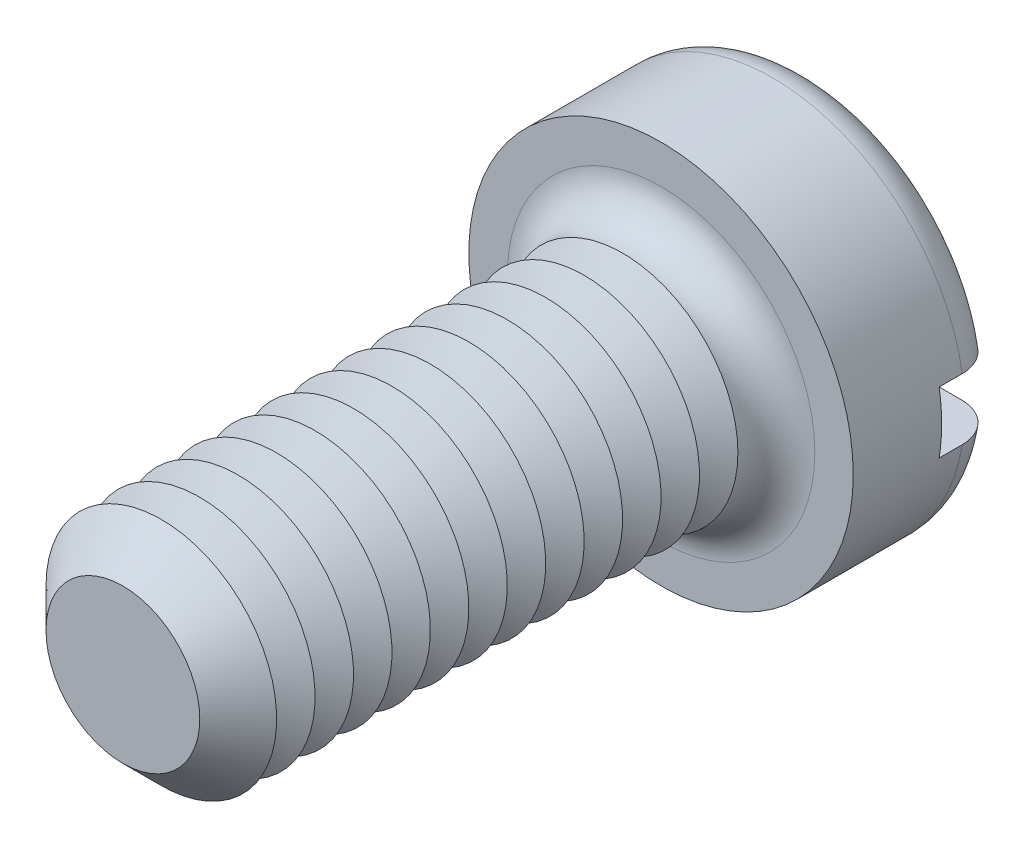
ISO-10303-21;
HEADER;
FILE_DESCRIPTION(('STEP AP214'),'2;1');
FILE_NAME('part.step','',(''),(''),'','','');
FILE_SCHEMA(('AUTOMOTIVE_DESIGN { 1 0 10303 214 1 1 1 1 }'));
ENDSEC;
DATA;
#1=APPLICATION_CONTEXT('core data for automotive mechanical design processes');
#2=APPLICATION_PROTOCOL_DEFINITION('international standard','automotive_design',2000,#1);
#3=PRODUCT_CONTEXT('',#1,'mechanical');
#4=PRODUCT('Part','Part','',(#3));
#5=PRODUCT_RELATED_PRODUCT_CATEGORY('part','',(#4));
#6=PRODUCT_DEFINITION_FORMATION('','',#4);
#7=PRODUCT_DEFINITION_CONTEXT('part definition',#1,'design');
#8=PRODUCT_DEFINITION('design','',#6,#7);
#9=PRODUCT_DEFINITION_SHAPE('','',#8);
#10=(LENGTH_UNIT() NAMED_UNIT(*) SI_UNIT(.MILLI.,.METRE.));
#11=(NAMED_UNIT(*) PLANE_ANGLE_UNIT() SI_UNIT($,.RADIAN.));
#12=(NAMED_UNIT(*) SI_UNIT($,.STERADIAN.) SOLID_ANGLE_UNIT());
#13=UNCERTAINTY_MEASURE_WITH_UNIT(LENGTH_MEASURE(1.E-05),#10,'distance_accuracy_value','');
#14=(GEOMETRIC_REPRESENTATION_CONTEXT(3) GLOBAL_UNCERTAINTY_ASSIGNED_CONTEXT((#13)) GLOBAL_UNIT_ASSIGNED_CONTEXT((#10,
#11,#12)) REPRESENTATION_CONTEXT('',''));
#15=CARTESIAN_POINT('',(0.,0.,0.));
#16=DIRECTION('',(0.,0.,1.));
#17=DIRECTION('',(1.,0.,0.));
#18=AXIS2_PLACEMENT_3D('',#15,#16,#17);
#19=CARTESIAN_POINT('',(0.,0.,-3.9));
#20=DIRECTION('',(0.,0.,1.));
#21=DIRECTION('',(1.,0.,0.));
#22=AXIS2_PLACEMENT_3D('',#19,#20,#21);
#23=PLANE('',#22);
#24=CARTESIAN_POINT('',(0.,0.,-3.9));
#25=DIRECTION('',(0.,0.,1.));
#26=DIRECTION('',(1.,0.,0.));
#27=AXIS2_PLACEMENT_3D('',#24,#25,#26);
#28=CIRCLE('',#27,4.);
#29=CARTESIAN_POINT('',(-3.91918358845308,0.800000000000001,-3.9));
#30=VERTEX_POINT('',#29);
#31=CARTESIAN_POINT('',(3.91918358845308,0.8,-3.9));
#32=VERTEX_POINT('',#31);
#33=EDGE_CURVE('E116',#30,#32,#28,.F.);
#34=ORIENTED_EDGE('',*,*,#33,.T.);
#35=DIRECTION('',(1.,0.,0.));
#36=VECTOR('',#35,1.);
#37=CARTESIAN_POINT('',(-5.,0.800000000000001,-3.9));
#38=LINE('',#37,#36);
#39=EDGE_CURVE('E111',#30,#32,#38,.T.);
#40=ORIENTED_EDGE('',*,*,#39,.F.);
#41=EDGE_LOOP('',(#34,#40));
#42=FACE_BOUND('',#41,.T.);
#43=ADVANCED_FACE('F39',(#42),#23,.F.);
#44=CARTESIAN_POINT('',(0.,0.,-2.9));
#45=DIRECTION('',(0.,0.,1.));
#46=DIRECTION('',(1.,0.,0.));
#47=AXIS2_PLACEMENT_3D('',#44,#45,#46);
#48=TOROIDAL_SURFACE('',#47,4.,1.);
#49=CARTESIAN_POINT('',(-4.76648512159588,0.800000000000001,-3.45304061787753));
#50=CARTESIAN_POINT('',(-4.73486405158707,0.800000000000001,-3.50001565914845));
#51=CARTESIAN_POINT('',(-4.69920787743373,0.800000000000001,-3.54432871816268));
#52=CARTESIAN_POINT('',(-4.62090302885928,0.800000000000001,-3.62634638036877));
#53=CARTESIAN_POINT('',(-4.57824494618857,0.800000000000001,-3.66404194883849));
#54=CARTESIAN_POINT('',(-4.48726975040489,0.800000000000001,-3.73172278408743));
#55=CARTESIAN_POINT('',(-4.43895902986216,0.800000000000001,-3.76171664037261));
#56=CARTESIAN_POINT('',(-4.33804923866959,0.800000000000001,-3.81326437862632));
#57=CARTESIAN_POINT('',(-4.2854512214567,0.800000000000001,-3.8348203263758));
#58=CARTESIAN_POINT('',(-4.17679895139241,0.800000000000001,-3.86918431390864));
#59=CARTESIAN_POINT('',(-4.12071163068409,0.800000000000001,-3.88188775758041));
#60=CARTESIAN_POINT('',(-4.00720729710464,0.800000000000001,-3.89785932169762));
#61=CARTESIAN_POINT('',(-3.94979011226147,0.800000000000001,-3.9011262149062));
#62=CARTESIAN_POINT('',(-3.83429042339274,0.800000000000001,-3.89816676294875));
#63=CARTESIAN_POINT('',(-3.77621176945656,0.800000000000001,-3.89178937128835));
#64=CARTESIAN_POINT('',(-3.66191938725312,0.800000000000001,-3.8694726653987));
#65=CARTESIAN_POINT('',(-3.60570580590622,0.800000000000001,-3.85353259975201));
#66=CARTESIAN_POINT('',(-3.49618749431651,0.800000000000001,-3.81233202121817));
#67=CARTESIAN_POINT('',(-3.44291561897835,0.800000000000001,-3.78698406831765));
#68=CARTESIAN_POINT('',(-3.34140774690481,0.800000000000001,-3.72766098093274));
#69=CARTESIAN_POINT('',(-3.29317182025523,0.800000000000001,-3.69368572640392));
#70=CARTESIAN_POINT('',(-3.20343355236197,0.800000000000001,-3.6182054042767));
#71=CARTESIAN_POINT('',(-3.16189680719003,0.800000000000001,-3.57674128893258));
#72=CARTESIAN_POINT('',(-3.08658236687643,0.800000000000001,-3.48727547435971));
#73=CARTESIAN_POINT('',(-3.05280364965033,0.800000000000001,-3.43927463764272));
#74=CARTESIAN_POINT('',(-2.99489532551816,0.800000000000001,-3.33932895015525));
#75=CARTESIAN_POINT('',(-2.97055012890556,0.800000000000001,-3.28750911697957));
#76=CARTESIAN_POINT('',(-2.93124252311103,0.800000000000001,-3.18042600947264));
#77=CARTESIAN_POINT('',(-2.91627793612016,0.800000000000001,-3.12516353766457));
#78=CARTESIAN_POINT('',(-2.89663075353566,0.800000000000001,-3.01470560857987));
#79=CARTESIAN_POINT('',(-2.89162828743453,0.800000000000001,-2.95956691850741));
#80=CARTESIAN_POINT('',(-2.89112479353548,0.800000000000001,-2.84924961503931));
#81=CARTESIAN_POINT('',(-2.89562264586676,0.800000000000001,-2.79407100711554));
#82=CARTESIAN_POINT('',(-2.91379565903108,0.800000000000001,-2.6861912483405));
#83=CARTESIAN_POINT('',(-2.92731815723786,0.800000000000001,-2.63346424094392));
#84=CARTESIAN_POINT('',(-2.96290888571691,0.800000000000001,-2.53098203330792));
#85=CARTESIAN_POINT('',(-2.98497757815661,0.800000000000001,-2.48122699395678));
#86=CARTESIAN_POINT('',(-3.03728055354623,0.800000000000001,-2.38535286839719));
#87=CARTESIAN_POINT('',(-3.06761989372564,0.800000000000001,-2.33929117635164));
#88=CARTESIAN_POINT('',(-3.13537950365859,0.800000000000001,-2.2527125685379));
#89=CARTESIAN_POINT('',(-3.17280082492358,0.800000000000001,-2.21219647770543));
#90=CARTESIAN_POINT('',(-3.2549164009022,0.800000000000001,-2.13651195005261));
#91=CARTESIAN_POINT('',(-3.29980186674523,0.800000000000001,-2.10155095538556));
#92=CARTESIAN_POINT('',(-3.39467666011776,0.800000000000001,-2.03942270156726));
#93=CARTESIAN_POINT('',(-3.44466673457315,0.800000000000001,-2.01225658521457));
#94=CARTESIAN_POINT('',(-3.5497933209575,0.800000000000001,-1.96576935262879));
#95=CARTESIAN_POINT('',(-3.60503228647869,0.800000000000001,-1.94667963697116));
#96=CARTESIAN_POINT('',(-3.71791613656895,0.800000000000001,-1.91794308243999));
#97=CARTESIAN_POINT('',(-3.77556119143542,0.800000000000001,-1.90829691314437));
#98=CARTESIAN_POINT('',(-3.89221522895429,0.800000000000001,-1.89869331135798));
#99=CARTESIAN_POINT('',(-3.9512319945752,0.800000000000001,-1.89882985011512));
#100=CARTESIAN_POINT('',(-4.06839541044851,0.800000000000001,-1.90907818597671));
#101=CARTESIAN_POINT('',(-4.12654207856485,0.800000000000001,-1.91918977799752));
#102=CARTESIAN_POINT('',(-4.23988103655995,0.800000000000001,-1.9490667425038));
#103=CARTESIAN_POINT('',(-4.29509069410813,0.800000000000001,-1.96876615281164));
#104=CARTESIAN_POINT('',(-4.40134194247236,0.800000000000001,-2.01729572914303));
#105=CARTESIAN_POINT('',(-4.45238383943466,0.800000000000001,-2.04612522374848));
#106=CARTESIAN_POINT('',(-4.54801343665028,0.800000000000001,-2.1116316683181));
#107=CARTESIAN_POINT('',(-4.59268768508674,0.800000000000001,-2.14818225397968));
#108=CARTESIAN_POINT('',(-4.67513924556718,0.800000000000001,-2.22837632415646));
#109=CARTESIAN_POINT('',(-4.71291715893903,0.800000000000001,-2.27201918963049));
#110=CARTESIAN_POINT('',(-4.77986554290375,0.800000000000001,-2.36439990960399));
#111=CARTESIAN_POINT('',(-4.80916462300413,0.800000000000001,-2.41304457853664));
#112=CARTESIAN_POINT('',(-4.85906149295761,0.800000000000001,-2.51460659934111));
#113=CARTESIAN_POINT('',(-4.8796602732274,0.800000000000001,-2.56752346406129));
#114=CARTESIAN_POINT('',(-4.9113264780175,0.800000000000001,-2.67542592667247));
#115=CARTESIAN_POINT('',(-4.92250819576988,0.800000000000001,-2.73037800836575));
#116=CARTESIAN_POINT('',(-4.93542682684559,0.800000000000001,-2.84139649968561));
#117=CARTESIAN_POINT('',(-4.93716171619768,0.800000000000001,-2.89746314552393));
#118=CARTESIAN_POINT('',(-4.93114851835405,0.800000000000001,-3.00876455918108));
#119=CARTESIAN_POINT('',(-4.92345325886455,0.800000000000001,-3.0640022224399));
#120=CARTESIAN_POINT('',(-4.8989032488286,0.800000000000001,-3.17235240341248));
#121=CARTESIAN_POINT('',(-4.88205998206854,0.800000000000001,-3.22546749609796));
#122=CARTESIAN_POINT('',(-4.84819200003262,0.800000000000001,-3.30764066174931));
#123=CARTESIAN_POINT('',(-4.83390853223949,0.800000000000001,-3.33785845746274));
#124=CARTESIAN_POINT('',(-4.80237957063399,0.800000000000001,-3.39670633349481));
#125=CARTESIAN_POINT('',(-4.78513409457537,0.800000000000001,-3.42533642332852));
#126=CARTESIAN_POINT('',(-4.76648512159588,0.800000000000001,-3.45304061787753));
#127=B_SPLINE_CURVE_WITH_KNOTS('',3,(#49,#50,#51,#52,#53,#54,#55,#56,#57,#58,#59,#60,#61,#62,
#63,#64,#65,#66,#67,#68,#69,#70,#71,#72,#73,#74,#75,#76,#77,#78,#79,#80,#81,#82,#83,#84,#85,#86,
#87,#88,#89,#90,#91,#92,#93,#94,#95,#96,#97,#98,#99,#100,#101,#102,#103,#104,#105,#106,#107,
#108,#109,#110,#111,#112,#113,#114,#115,#116,#117,#118,#119,#120,#121,#122,#123,#124,#125,#126),
.UNSPECIFIED.,.T.,.F.,(4,2,2,2,2,2,2,2,2,2,2,2,2,2,2,2,2,2,2,2,2,2,2,2,2,2,2,2,2,2,2,2,2,2,2,2,
2,2,4),(0.,0.169755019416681,0.339740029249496,0.509534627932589,0.67928763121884,
0.851013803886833,1.02276230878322,1.19722869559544,1.37170879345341,1.54785292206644,
1.72399950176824,1.89921049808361,2.07439839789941,2.24530597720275,2.41617386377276,
2.58146078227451,2.74672821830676,2.90926852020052,3.0718176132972,3.2365363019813,
3.40127946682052,3.57118676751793,3.74111896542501,3.91563534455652,4.09016409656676,
4.26636956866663,4.4425714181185,4.61757781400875,4.79257134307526,4.96489650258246,
5.13720662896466,5.30674670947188,5.47626748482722,5.64369988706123,5.81116816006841,
5.97770254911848,6.14402836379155,6.24414438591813,6.34425980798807),.UNSPECIFIED.);
#128=CARTESIAN_POINT('',(-4.93558507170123,0.800000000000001,-2.9));
#129=VERTEX_POINT('',#128);
#130=EDGE_CURVE('E275',#129,#30,#127,.T.);
#131=ORIENTED_EDGE('',*,*,#130,.F.);
#132=CARTESIAN_POINT('',(0.,0.,-2.9));
#133=DIRECTION('',(0.,0.,1.));
#134=DIRECTION('',(1.,0.,0.));
#135=AXIS2_PLACEMENT_3D('',#132,#133,#134);
#136=CIRCLE('',#135,5.);
#137=CARTESIAN_POINT('',(4.93558507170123,0.8,-2.9));
#138=VERTEX_POINT('',#137);
#139=EDGE_CURVE('E125',#138,#129,#136,.T.);
#140=ORIENTED_EDGE('',*,*,#139,.F.);
#141=CARTESIAN_POINT('',(2.98553785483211,0.8,-3.31649797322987));
#142=CARTESIAN_POINT('',(3.00991125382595,0.8,-3.36788093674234));
#143=CARTESIAN_POINT('',(3.03875556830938,0.8,-3.41719756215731));
#144=CARTESIAN_POINT('',(3.1043993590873,0.8,-3.51028676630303));
#145=CARTESIAN_POINT('',(3.1412115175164,0.8,-3.55405032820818));
#146=CARTESIAN_POINT('',(3.22153641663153,0.8,-3.63476402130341));
#147=CARTESIAN_POINT('',(3.26503706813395,0.8,-3.67172618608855));
#148=CARTESIAN_POINT('',(3.35749627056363,0.8,-3.73799476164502));
#149=CARTESIAN_POINT('',(3.4064533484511,0.8,-3.76730323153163));
#150=CARTESIAN_POINT('',(3.5095773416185,0.8,-3.81809642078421));
#151=CARTESIAN_POINT('',(3.56383317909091,0.8,-3.83940072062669));
#152=CARTESIAN_POINT('',(3.67513017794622,0.8,-3.87272481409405));
#153=CARTESIAN_POINT('',(3.7321717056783,0.8,-3.88474338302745));
#154=CARTESIAN_POINT('',(3.84815688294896,0.8,-3.89923413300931));
#155=CARTESIAN_POINT('',(3.90711516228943,0.8,-3.9015896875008));
#156=CARTESIAN_POINT('',(4.02458610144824,0.8,-3.89631753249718));
#157=CARTESIAN_POINT('',(4.08309876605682,0.8,-3.8886899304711));
#158=CARTESIAN_POINT('',(4.19768646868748,0.8,-3.86366584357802));
#159=CARTESIAN_POINT('',(4.25377243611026,0.8,-3.84631948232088));
#160=CARTESIAN_POINT('',(4.3621676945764,0.8,-3.80231797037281));
#161=CARTESIAN_POINT('',(4.41447726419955,0.8,-3.77566350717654));
#162=CARTESIAN_POINT('',(4.51300872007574,0.8,-3.71421163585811));
#163=CARTESIAN_POINT('',(4.5593085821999,0.8,-3.67953927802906));
#164=CARTESIAN_POINT('',(4.64530675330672,0.8,-3.60279495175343));
#165=CARTESIAN_POINT('',(4.68500564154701,0.8,-3.56072363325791));
#166=CARTESIAN_POINT('',(4.75599202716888,0.8,-3.47111750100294));
#167=CARTESIAN_POINT('',(4.7874061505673,0.8,-3.42368298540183));
#168=CARTESIAN_POINT('',(4.84170328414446,0.8,-3.32415927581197));
#169=CARTESIAN_POINT('',(4.86458695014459,0.8,-3.2720704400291));
#170=CARTESIAN_POINT('',(4.90088120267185,0.8,-3.16544016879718));
#171=CARTESIAN_POINT('',(4.91440984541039,0.8,-3.11093889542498));
#172=CARTESIAN_POINT('',(4.93205429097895,0.8,-3.00043391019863));
#173=CARTESIAN_POINT('',(4.93617053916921,0.8,-2.9444302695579));
#174=CARTESIAN_POINT('',(4.93486973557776,0.8,-2.83292218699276));
#175=CARTESIAN_POINT('',(4.92951827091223,0.8,-2.77741696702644));
#176=CARTESIAN_POINT('',(4.90957104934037,0.8,-2.66809456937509));
#177=CARTESIAN_POINT('',(4.89497541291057,0.8,-2.61427736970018));
#178=CARTESIAN_POINT('',(4.85697876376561,0.8,-2.50985095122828));
#179=CARTESIAN_POINT('',(4.83357805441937,0.8,-2.45924162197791));
#180=CARTESIAN_POINT('',(4.77866660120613,0.8,-2.36263484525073));
#181=CARTESIAN_POINT('',(4.74715567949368,0.8,-2.31663749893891));
#182=CARTESIAN_POINT('',(4.67670791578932,0.8,-2.23021464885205));
#183=CARTESIAN_POINT('',(4.6377224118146,0.8,-2.1898288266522));
#184=CARTESIAN_POINT('',(4.55359880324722,0.8,-2.11607828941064));
#185=CARTESIAN_POINT('',(4.50846036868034,0.8,-2.08271395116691));
#186=CARTESIAN_POINT('',(4.41271544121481,0.8,-2.02349513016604));
#187=CARTESIAN_POINT('',(4.36204749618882,0.8,-1.99774003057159));
#188=CARTESIAN_POINT('',(4.257155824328,0.8,-1.95495040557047));
#189=CARTESIAN_POINT('',(4.20293181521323,0.8,-1.93791657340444));
#190=CARTESIAN_POINT('',(4.09154156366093,0.8,-1.91276335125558));
#191=CARTESIAN_POINT('',(4.03434212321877,0.8,-1.90479098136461));
#192=CARTESIAN_POINT('',(3.91941228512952,0.8,-1.89840884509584));
#193=CARTESIAN_POINT('',(3.8616818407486,0.8,-1.89999992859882));
#194=CARTESIAN_POINT('',(3.7464111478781,0.8,-1.91275144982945));
#195=CARTESIAN_POINT('',(3.6888866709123,0.8,-1.92405471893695));
#196=CARTESIAN_POINT('',(3.57652290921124,0.8,-1.95609086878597));
#197=CARTESIAN_POINT('',(3.52168382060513,0.8,-1.97682443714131));
#198=CARTESIAN_POINT('',(3.41589179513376,0.8,-2.02733294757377));
#199=CARTESIAN_POINT('',(3.36496676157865,0.8,-2.05716640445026));
#200=CARTESIAN_POINT('',(3.26890903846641,0.8,-2.12504079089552));
#201=CARTESIAN_POINT('',(3.22377627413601,0.8,-2.16308161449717));
#202=CARTESIAN_POINT('',(3.141135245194,0.8,-2.24593284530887));
#203=CARTESIAN_POINT('',(3.1035541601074,0.8,-2.29067053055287));
#204=CARTESIAN_POINT('',(3.03669700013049,0.8,-2.38597317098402));
#205=CARTESIAN_POINT('',(3.00741914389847,0.8,-2.43653687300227));
#206=CARTESIAN_POINT('',(2.95891799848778,0.8,-2.54052959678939));
#207=CARTESIAN_POINT('',(2.93943249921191,0.8,-2.59383627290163));
#208=CARTESIAN_POINT('',(2.9100081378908,0.8,-2.70303736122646));
#209=CARTESIAN_POINT('',(2.90006970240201,0.8,-2.75893188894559));
#210=CARTESIAN_POINT('',(2.89027863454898,0.8,-2.86986958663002));
#211=CARTESIAN_POINT('',(2.89012791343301,0.8,-2.92488680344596));
#212=CARTESIAN_POINT('',(2.89917145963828,0.8,-3.03409648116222));
#213=CARTESIAN_POINT('',(2.90835313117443,0.8,-3.08828995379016));
#214=CARTESIAN_POINT('',(2.92977618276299,0.8,-3.17141652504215));
#215=CARTESIAN_POINT('',(2.93899011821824,0.8,-3.20116372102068));
#216=CARTESIAN_POINT('',(2.96020249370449,0.8,-3.25964614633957));
#217=CARTESIAN_POINT('',(2.97220082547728,0.8,-3.28838141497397));
#218=CARTESIAN_POINT('',(2.98553785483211,0.8,-3.31649797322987));
#219=B_SPLINE_CURVE_WITH_KNOTS('',3,(#141,#142,#143,#144,#145,#146,#147,#148,#149,#150,#151,
#152,#153,#154,#155,#156,#157,#158,#159,#160,#161,#162,#163,#164,#165,#166,#167,#168,#169,#170,
#171,#172,#173,#174,#175,#176,#177,#178,#179,#180,#181,#182,#183,#184,#185,#186,#187,#188,#189,
#190,#191,#192,#193,#194,#195,#196,#197,#198,#199,#200,#201,#202,#203,#204,#205,#206,#207,#208,
#209,#210,#211,#212,#213,#214,#215,#216,#217,#218),.UNSPECIFIED.,.T.,.F.,(4,2,2,2,2,2,2,2,2,2,2,
2,2,2,2,2,2,2,2,2,2,2,2,2,2,2,2,2,2,2,2,2,2,2,2,2,2,2,4),(0.,0.170493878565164,
0.341261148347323,0.511723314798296,0.682139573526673,0.856194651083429,1.03027268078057,
1.20644565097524,1.38261672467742,1.55788746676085,1.73314526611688,1.90583484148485,
2.07850925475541,2.24836742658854,2.41821253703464,2.58587311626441,2.75352576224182,
2.92002154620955,3.08651516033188,3.25300303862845,3.41949456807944,3.58710926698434,
3.75473295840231,3.92445790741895,4.09419634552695,4.26665110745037,4.43912119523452,
4.61417197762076,4.78923552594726,4.96544940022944,5.1416609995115,5.31608191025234,
5.49046537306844,5.65989063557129,5.82932346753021,5.99359365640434,6.157642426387,
6.250939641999,6.34423323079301),.UNSPECIFIED.);
#220=EDGE_CURVE('E277',#32,#138,#219,.T.);
#221=ORIENTED_EDGE('',*,*,#220,.F.);
#222=ORIENTED_EDGE('',*,*,#33,.F.);
#223=EDGE_LOOP('',(#131,#140,#221,#222));
#224=FACE_BOUND('',#223,.T.);
#225=ADVANCED_FACE('F259',(#224),#48,.T.);
#226=CARTESIAN_POINT('',(0.,0.,-3.9));
#227=DIRECTION('',(0.,0.,1.));
#228=DIRECTION('',(1.,0.,0.));
#229=AXIS2_PLACEMENT_3D('',#226,#227,#228);
#230=CYLINDRICAL_SURFACE('',#229,5.);
#231=DIRECTION('',(0.,0.,1.));
#232=VECTOR('',#231,1.);
#233=CARTESIAN_POINT('',(4.93558507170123,0.8,-3.9));
#234=LINE('',#233,#232);
#235=CARTESIAN_POINT('',(4.93558507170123,0.8,-2.3));
#236=VERTEX_POINT('',#235);
#237=EDGE_CURVE('E292',#138,#236,#234,.T.);
#238=ORIENTED_EDGE('',*,*,#237,.F.);
#239=ORIENTED_EDGE('',*,*,#139,.T.);
#240=DIRECTION('',(0.,0.,1.));
#241=VECTOR('',#240,1.);
#242=CARTESIAN_POINT('',(-4.93558507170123,0.800000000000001,-3.9));
#243=LINE('',#242,#241);
#244=CARTESIAN_POINT('',(-4.93558507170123,0.800000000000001,-2.3));
#245=VERTEX_POINT('',#244);
#246=EDGE_CURVE('E63',#245,#129,#243,.F.);
#247=ORIENTED_EDGE('',*,*,#246,.F.);
#248=CARTESIAN_POINT('',(0.,0.,-2.3));
#249=DIRECTION('',(0.,0.,-1.));
#250=DIRECTION('',(-1.,0.,0.));
#251=AXIS2_PLACEMENT_3D('',#248,#249,#250);
#252=CIRCLE('',#251,5.);
#253=CARTESIAN_POINT('',(-4.93558507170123,-0.799999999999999,-2.3));
#254=VERTEX_POINT('',#253);
#255=EDGE_CURVE('E43',#245,#254,#252,.F.);
#256=ORIENTED_EDGE('',*,*,#255,.T.);
#257=DIRECTION('',(0.,0.,1.));
#258=VECTOR('',#257,1.);
#259=CARTESIAN_POINT('',(-4.93558507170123,-0.799999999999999,-3.9));
#260=LINE('',#259,#258);
#261=CARTESIAN_POINT('',(-4.93558507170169,-0.799999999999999,-2.89999999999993));
#262=VERTEX_POINT('',#261);
#263=EDGE_CURVE('E289',#262,#254,#260,.T.);
#264=ORIENTED_EDGE('',*,*,#263,.F.);
#265=CARTESIAN_POINT('',(4.93558507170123,-0.8,-2.9));
#266=VERTEX_POINT('',#265);
#267=EDGE_CURVE('E127',#262,#266,#136,.T.);
#268=ORIENTED_EDGE('',*,*,#267,.T.);
#269=DIRECTION('',(0.,0.,1.));
#270=VECTOR('',#269,1.);
#271=CARTESIAN_POINT('',(4.93558507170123,-0.8,-3.9));
#272=LINE('',#271,#270);
#273=CARTESIAN_POINT('',(4.93558507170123,-0.8,-2.3));
#274=VERTEX_POINT('',#273);
#275=EDGE_CURVE('E55',#274,#266,#272,.F.);
#276=ORIENTED_EDGE('',*,*,#275,.F.);
#277=EDGE_CURVE('E11',#274,#236,#252,.F.);
#278=ORIENTED_EDGE('',*,*,#277,.T.);
#279=EDGE_LOOP('',(#238,#239,#247,#256,#264,#268,#276,#278));
#280=FACE_BOUND('',#279,.T.);
#281=CARTESIAN_POINT('',(0.,0.,0.));
#282=DIRECTION('',(0.,0.,1.));
#283=DIRECTION('',(1.,0.,0.));
#284=AXIS2_PLACEMENT_3D('',#281,#282,#283);
#285=CIRCLE('',#284,5.);
#286=CARTESIAN_POINT('',(5.,0.,0.));
#287=VERTEX_POINT('',#286);
#288=EDGE_CURVE('E295',#287,#287,#285,.T.);
#289=ORIENTED_EDGE('',*,*,#288,.F.);
#290=EDGE_LOOP('',(#289));
#291=FACE_BOUND('',#290,.T.);
#292=ADVANCED_FACE('F255',(#280,#291),#230,.T.);
#293=CARTESIAN_POINT('',(3.91918358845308,-0.8,-3.9));
#294=VERTEX_POINT('',#293);
#295=CARTESIAN_POINT('',(-3.91918358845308,-0.799999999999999,-3.9));
#296=VERTEX_POINT('',#295);
#297=EDGE_CURVE('E109',#294,#296,#28,.F.);
#298=ORIENTED_EDGE('',*,*,#297,.T.);
#299=DIRECTION('',(-1.,0.,0.));
#300=VECTOR('',#299,1.);
#301=CARTESIAN_POINT('',(-5.,-0.799999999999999,-3.9));
#302=LINE('',#301,#300);
#303=EDGE_CURVE('E96',#294,#296,#302,.T.);
#304=ORIENTED_EDGE('',*,*,#303,.F.);
#305=EDGE_LOOP('',(#298,#304));
#306=FACE_BOUND('',#305,.T.);
#307=ADVANCED_FACE('F108',(#306),#23,.F.);
#308=CARTESIAN_POINT('',(0.,0.,0.));
#309=DIRECTION('',(0.,0.,1.));
#310=DIRECTION('',(1.,0.,0.));
#311=AXIS2_PLACEMENT_3D('',#308,#309,#310);
#312=PLANE('',#311);
#313=CARTESIAN_POINT('',(0.,0.,0.));
#314=DIRECTION('',(0.,0.,1.));
#315=DIRECTION('',(1.,0.,0.));
#316=AXIS2_PLACEMENT_3D('',#313,#314,#315);
#317=CIRCLE('',#316,4.);
#318=CARTESIAN_POINT('',(4.,0.,0.));
#319=VERTEX_POINT('',#318);
#320=EDGE_CURVE('E115',#319,#319,#317,.F.);
#321=ORIENTED_EDGE('',*,*,#320,.T.);
#322=EDGE_LOOP('',(#321));
#323=FACE_BOUND('',#322,.T.);
#324=ORIENTED_EDGE('',*,*,#288,.T.);
#325=EDGE_LOOP('',(#324));
#326=FACE_BOUND('',#325,.T.);
#327=ADVANCED_FACE('F254',(#323,#326),#312,.T.);
#328=CARTESIAN_POINT('',(-4.76648512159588,-0.799999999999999,-3.45304061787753));
#329=CARTESIAN_POINT('',(-4.7975694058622,-0.799999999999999,-3.40685392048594));
#330=CARTESIAN_POINT('',(-4.82479903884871,-0.799999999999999,-3.35802740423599));
#331=CARTESIAN_POINT('',(-4.87070632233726,-0.799999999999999,-3.25646127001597));
#332=CARTESIAN_POINT('',(-4.8893747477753,-0.799999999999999,-3.20371750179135));
#333=CARTESIAN_POINT('',(-4.91756720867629,-0.799999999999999,-3.09584501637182));
#334=CARTESIAN_POINT('',(-4.92709302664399,-0.799999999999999,-3.04071676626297));
#335=CARTESIAN_POINT('',(-4.93671217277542,-0.799999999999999,-2.92965669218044));
#336=CARTESIAN_POINT('',(-4.93680767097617,-0.799999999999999,-2.87372505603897));
#337=CARTESIAN_POINT('',(-4.92758675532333,-0.799999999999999,-2.76284675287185));
#338=CARTESIAN_POINT('',(-4.91830421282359,-0.799999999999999,-2.70789726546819));
#339=CARTESIAN_POINT('',(-4.89065741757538,-0.799999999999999,-2.60033228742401));
#340=CARTESIAN_POINT('',(-4.87229291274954,-0.799999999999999,-2.54771686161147));
#341=CARTESIAN_POINT('',(-4.82699855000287,-0.799999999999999,-2.44622441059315));
#342=CARTESIAN_POINT('',(-4.80005659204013,-0.799999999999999,-2.39735278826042));
#343=CARTESIAN_POINT('',(-4.73841244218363,-0.799999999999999,-2.30477947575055));
#344=CARTESIAN_POINT('',(-4.70371003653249,-0.799999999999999,-2.26107792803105));
#345=CARTESIAN_POINT('',(-4.62724516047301,-0.799999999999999,-2.17969334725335));
#346=CARTESIAN_POINT('',(-4.58542787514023,-0.799999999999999,-2.14206183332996));
#347=CARTESIAN_POINT('',(-4.49614171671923,-0.799999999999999,-2.07424284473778));
#348=CARTESIAN_POINT('',(-4.44867251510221,-0.799999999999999,-2.04405580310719));
#349=CARTESIAN_POINT('',(-4.34875035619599,-0.799999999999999,-1.99153688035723));
#350=CARTESIAN_POINT('',(-4.29623870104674,-0.799999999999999,-1.96931670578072));
#351=CARTESIAN_POINT('',(-4.18826905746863,-0.799999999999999,-1.93384994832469));
#352=CARTESIAN_POINT('',(-4.1328108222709,-0.799999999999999,-1.92060411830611));
#353=CARTESIAN_POINT('',(-4.01956054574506,-0.799999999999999,-1.90323798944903));
#354=CARTESIAN_POINT('',(-3.96174522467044,-0.799999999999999,-1.89926947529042));
#355=CARTESIAN_POINT('',(-3.84625419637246,-0.799999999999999,-1.90095183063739));
#356=CARTESIAN_POINT('',(-3.78857850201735,-0.799999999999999,-1.90660355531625));
#357=CARTESIAN_POINT('',(-3.67415602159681,-0.799999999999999,-1.92748272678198));
#358=CARTESIAN_POINT('',(-3.61743328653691,-0.799999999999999,-1.94284216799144));
#359=CARTESIAN_POINT('',(-3.50734962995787,-0.799999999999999,-1.9828275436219));
#360=CARTESIAN_POINT('',(-3.4539889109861,-0.799999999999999,-2.00745403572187));
#361=CARTESIAN_POINT('',(-3.35197118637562,-0.799999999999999,-2.06542964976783));
#362=CARTESIAN_POINT('',(-3.30333217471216,-0.799999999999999,-2.0988104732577));
#363=CARTESIAN_POINT('',(-3.21244692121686,-0.799999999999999,-2.17337326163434));
#364=CARTESIAN_POINT('',(-3.17020039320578,-0.799999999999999,-2.21455487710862));
#365=CARTESIAN_POINT('',(-3.0940098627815,-0.799999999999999,-2.30296695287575));
#366=CARTESIAN_POINT('',(-3.05995540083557,-0.799999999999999,-2.35010211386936));
#367=CARTESIAN_POINT('',(-3.00053815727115,-0.799999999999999,-2.4495670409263));
#368=CARTESIAN_POINT('',(-2.97517362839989,-0.799999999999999,-2.50189576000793));
#369=CARTESIAN_POINT('',(-2.93470320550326,-0.799999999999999,-2.60853979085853));
#370=CARTESIAN_POINT('',(-2.91930557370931,-0.799999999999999,-2.66274437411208));
#371=CARTESIAN_POINT('',(-2.89812734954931,-0.799999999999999,-2.77299836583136));
#372=CARTESIAN_POINT('',(-2.89234481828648,-0.799999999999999,-2.82904740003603));
#373=CARTESIAN_POINT('',(-2.89064073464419,-0.799999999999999,-2.93970612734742));
#374=CARTESIAN_POINT('',(-2.89444549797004,-0.799999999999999,-2.99431180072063));
#375=CARTESIAN_POINT('',(-2.9112006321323,-0.799999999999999,-3.10209766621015));
#376=CARTESIAN_POINT('',(-2.9241507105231,-0.799999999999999,-3.1552779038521));
#377=CARTESIAN_POINT('',(-2.95868580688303,-0.799999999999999,-3.25858631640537));
#378=CARTESIAN_POINT('',(-2.98024709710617,-0.799999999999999,-3.30872244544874));
#379=CARTESIAN_POINT('',(-3.03128544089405,-0.799999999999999,-3.40478519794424));
#380=CARTESIAN_POINT('',(-3.06076335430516,-0.799999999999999,-3.45071136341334));
#381=CARTESIAN_POINT('',(-3.12753448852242,-0.799999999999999,-3.53826932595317));
#382=CARTESIAN_POINT('',(-3.16500083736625,-0.799999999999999,-3.57976901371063));
#383=CARTESIAN_POINT('',(-3.24617503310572,-0.799999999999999,-3.65613204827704));
#384=CARTESIAN_POINT('',(-3.28988388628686,-0.799999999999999,-3.69099432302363));
#385=CARTESIAN_POINT('',(-3.38380639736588,-0.799999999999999,-3.75424083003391));
#386=CARTESIAN_POINT('',(-3.43418287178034,-0.799999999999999,-3.78238342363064));
#387=CARTESIAN_POINT('',(-3.53887888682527,-0.799999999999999,-3.83000231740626));
#388=CARTESIAN_POINT('',(-3.59319889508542,-0.799999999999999,-3.84947758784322));
#389=CARTESIAN_POINT('',(-3.70539237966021,-0.799999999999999,-3.87954336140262));
#390=CARTESIAN_POINT('',(-3.76331464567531,-0.799999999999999,-3.88995217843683));
#391=CARTESIAN_POINT('',(-3.88008461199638,-0.799999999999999,-3.9009132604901));
#392=CARTESIAN_POINT('',(-3.93893230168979,-0.799999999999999,-3.9014656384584));
#393=CARTESIAN_POINT('',(-4.05594892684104,-0.799999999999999,-3.89264187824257));
#394=CARTESIAN_POINT('',(-4.11411702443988,-0.799999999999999,-3.88325457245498));
#395=CARTESIAN_POINT('',(-4.22802928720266,-0.799999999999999,-3.85472582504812));
#396=CARTESIAN_POINT('',(-4.28377297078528,-0.799999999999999,-3.83558245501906));
#397=CARTESIAN_POINT('',(-4.39054463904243,-0.799999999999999,-3.78829842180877));
#398=CARTESIAN_POINT('',(-4.44161887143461,-0.799999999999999,-3.76026208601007));
#399=CARTESIAN_POINT('',(-4.53818016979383,-0.799999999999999,-3.69589278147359));
#400=CARTESIAN_POINT('',(-4.58367442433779,-0.799999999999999,-3.65957066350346));
#401=CARTESIAN_POINT('',(-4.65208830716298,-0.799999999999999,-3.59453310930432));
#402=CARTESIAN_POINT('',(-4.67711825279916,-0.799999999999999,-3.56800018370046));
#403=CARTESIAN_POINT('',(-4.72414423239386,-0.799999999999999,-3.51236863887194));
#404=CARTESIAN_POINT('',(-4.74614029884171,-0.799999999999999,-3.48327004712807));
#405=CARTESIAN_POINT('',(-4.76648512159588,-0.799999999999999,-3.45304061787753));
#406=B_SPLINE_CURVE_WITH_KNOTS('',3,(#328,#329,#330,#331,#332,#333,#334,#335,#336,#337,#338,
#339,#340,#341,#342,#343,#344,#345,#346,#347,#348,#349,#350,#351,#352,#353,#354,#355,#356,#357,
#358,#359,#360,#361,#362,#363,#364,#365,#366,#367,#368,#369,#370,#371,#372,#373,#374,#375,#376,
#377,#378,#379,#380,#381,#382,#383,#384,#385,#386,#387,#388,#389,#390,#391,#392,#393,#394,#395,
#396,#397,#398,#399,#400,#401,#402,#403,#404,#405),.UNSPECIFIED.,.T.,.F.,(4,2,2,2,2,2,2,2,2,2,2,
2,2,2,2,2,2,2,2,2,2,2,2,2,2,2,2,2,2,2,2,2,2,2,2,2,2,2,4),(0.,0.166886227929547,
0.333951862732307,0.500984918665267,0.667979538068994,0.834373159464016,1.00077139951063,
1.16740542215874,1.33404403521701,1.50202999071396,1.67002571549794,1.84029248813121,
2.01057354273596,2.18362161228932,2.35668506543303,2.53215380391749,2.70763310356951,
2.88375684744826,3.05987270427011,3.23346085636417,3.40701408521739,3.57522519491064,
3.74340238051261,3.90683338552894,4.0702591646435,4.23323770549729,4.39623395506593,
4.56320691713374,4.7302068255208,4.90252468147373,5.07486300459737,5.25058028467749,
5.42629555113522,5.60220844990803,5.77815613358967,5.95211162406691,6.12584060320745,
6.23506966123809,6.34429754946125),.UNSPECIFIED.);
#407=EDGE_CURVE('E103',#296,#262,#406,.T.);
#408=ORIENTED_EDGE('',*,*,#407,.F.);
#409=ORIENTED_EDGE('',*,*,#297,.F.);
#410=CARTESIAN_POINT('',(2.98553785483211,-0.8,-3.31649797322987));
#411=CARTESIAN_POINT('',(2.96216773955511,-0.8,-3.26721849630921));
#412=CARTESIAN_POINT('',(2.94287503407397,-0.8,-3.21596872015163));
#413=CARTESIAN_POINT('',(2.91313258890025,-0.8,-3.11092723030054));
#414=CARTESIAN_POINT('',(2.9026902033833,-0.8,-3.0571334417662));
#415=CARTESIAN_POINT('',(2.89104377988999,-0.8,-2.94853922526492));
#416=CARTESIAN_POINT('',(2.88984130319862,-0.8,-2.89373862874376));
#417=CARTESIAN_POINT('',(2.89672585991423,-0.8,-2.78473646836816));
#418=CARTESIAN_POINT('',(2.90481120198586,-0.8,-2.73053479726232));
#419=CARTESIAN_POINT('',(2.92989134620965,-0.8,-2.62460092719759));
#420=CARTESIAN_POINT('',(2.94682969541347,-0.8,-2.57285532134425));
#421=CARTESIAN_POINT('',(2.9889990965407,-0.8,-2.47286425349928));
#422=CARTESIAN_POINT('',(3.01423103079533,-0.8,-2.42461916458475));
#423=CARTESIAN_POINT('',(3.07271536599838,-0.8,-2.33201565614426));
#424=CARTESIAN_POINT('',(3.10610710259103,-0.8,-2.28774532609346));
#425=CARTESIAN_POINT('',(3.17963417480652,-0.8,-2.205215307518));
#426=CARTESIAN_POINT('',(3.21977054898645,-0.8,-2.16695654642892));
#427=CARTESIAN_POINT('',(3.3070361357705,-0.8,-2.09624274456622));
#428=CARTESIAN_POINT('',(3.35434874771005,-0.8,-2.06401396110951));
#429=CARTESIAN_POINT('',(3.45361131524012,-0.8,-2.00773436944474));
#430=CARTESIAN_POINT('',(3.50556189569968,-0.8,-1.98368466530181));
#431=CARTESIAN_POINT('',(3.61398433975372,-0.8,-1.94389460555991));
#432=CARTESIAN_POINT('',(3.67053506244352,-0.8,-1.92836880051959));
#433=CARTESIAN_POINT('',(3.78543606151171,-0.8,-1.90696594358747));
#434=CARTESIAN_POINT('',(3.84378643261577,-0.8,-1.90108940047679));
#435=CARTESIAN_POINT('',(3.96100201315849,-0.8,-1.89918115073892));
#436=CARTESIAN_POINT('',(4.01986821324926,-0.8,-1.90320860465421));
#437=CARTESIAN_POINT('',(4.13606891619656,-0.8,-1.9211820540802));
#438=CARTESIAN_POINT('',(4.19340347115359,-0.8,-1.93512771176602));
#439=CARTESIAN_POINT('',(4.30434213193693,-0.8,-1.97243705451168));
#440=CARTESIAN_POINT('',(4.35797549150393,-0.8,-1.99571368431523));
#441=CARTESIAN_POINT('',(4.46048254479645,-0.8,-2.0510826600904));
#442=CARTESIAN_POINT('',(4.50935662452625,-0.8,-2.08317429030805));
#443=CARTESIAN_POINT('',(4.60012348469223,-0.8,-2.15471647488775));
#444=CARTESIAN_POINT('',(4.64211506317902,-0.8,-2.19404167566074));
#445=CARTESIAN_POINT('',(4.71877054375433,-0.8,-2.27928299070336));
#446=CARTESIAN_POINT('',(4.75343508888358,-0.8,-2.32519852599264));
#447=CARTESIAN_POINT('',(4.81388799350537,-0.8,-2.4215411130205));
#448=CARTESIAN_POINT('',(4.83980652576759,-0.8,-2.47188650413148));
#449=CARTESIAN_POINT('',(4.88271402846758,-0.8,-2.57624865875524));
#450=CARTESIAN_POINT('',(4.89970360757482,-0.8,-2.63026517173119));
#451=CARTESIAN_POINT('',(4.92409334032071,-0.8,-2.73978844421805));
#452=CARTESIAN_POINT('',(4.93159814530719,-0.8,-2.79527191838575));
#453=CARTESIAN_POINT('',(4.93713723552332,-0.8,-2.90670881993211));
#454=CARTESIAN_POINT('',(4.9351718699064,-0.8,-2.9626622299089));
#455=CARTESIAN_POINT('',(4.92186293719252,-0.8,-3.07317093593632));
#456=CARTESIAN_POINT('',(4.91056393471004,-0.8,-3.12773160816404));
#457=CARTESIAN_POINT('',(4.87898532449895,-0.8,-3.234187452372));
#458=CARTESIAN_POINT('',(4.85870572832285,-0.8,-3.28608262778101));
#459=CARTESIAN_POINT('',(4.80971634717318,-0.8,-3.38586723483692));
#460=CARTESIAN_POINT('',(4.78098824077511,-0.8,-3.43374766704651));
#461=CARTESIAN_POINT('',(4.71596686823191,-0.8,-3.52405937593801));
#462=CARTESIAN_POINT('',(4.67967336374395,-0.8,-3.56649048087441));
#463=CARTESIAN_POINT('',(4.60022577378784,-0.8,-3.64511036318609));
#464=CARTESIAN_POINT('',(4.5570143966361,-0.8,-3.6812412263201));
#465=CARTESIAN_POINT('',(4.4652099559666,-0.8,-3.7458530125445));
#466=CARTESIAN_POINT('',(4.41661654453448,-0.8,-3.77433344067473));
#467=CARTESIAN_POINT('',(4.31470683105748,-0.8,-3.82326981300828));
#468=CARTESIAN_POINT('',(4.26133399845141,-0.8,-3.84360800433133));
#469=CARTESIAN_POINT('',(4.15196444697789,-0.8,-3.87519515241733));
#470=CARTESIAN_POINT('',(4.09596750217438,-0.8,-3.88644332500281));
#471=CARTESIAN_POINT('',(3.98196469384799,-0.8,-3.89971870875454));
#472=CARTESIAN_POINT('',(3.92394096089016,-0.8,-3.901592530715));
#473=CARTESIAN_POINT('',(3.8083852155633,-0.8,-3.89570840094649));
#474=CARTESIAN_POINT('',(3.75085322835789,-0.8,-3.88794995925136));
#475=CARTESIAN_POINT('',(3.6371167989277,-0.8,-3.86287824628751));
#476=CARTESIAN_POINT('',(3.58093962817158,-0.8,-3.84544111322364));
#477=CARTESIAN_POINT('',(3.47227948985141,-0.8,-3.80139971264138));
#478=CARTESIAN_POINT('',(3.41979762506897,-0.8,-3.77479272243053));
#479=CARTESIAN_POINT('',(3.31994061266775,-0.8,-3.71304199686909));
#480=CARTESIAN_POINT('',(3.27257854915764,-0.8,-3.67787710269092));
#481=CARTESIAN_POINT('',(3.18459619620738,-0.8,-3.59999704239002));
#482=CARTESIAN_POINT('',(3.14396747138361,-0.8,-3.55729146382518));
#483=CARTESIAN_POINT('',(3.08341110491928,-0.8,-3.48140072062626));
#484=CARTESIAN_POINT('',(3.06118126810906,-0.8,-3.45002448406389));
#485=CARTESIAN_POINT('',(3.02047302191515,-0.8,-3.38492378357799));
#486=CARTESIAN_POINT('',(3.00199451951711,-0.8,-3.35119937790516));
#487=CARTESIAN_POINT('',(2.98553785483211,-0.8,-3.31649797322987));
#488=B_SPLINE_CURVE_WITH_KNOTS('',3,(#410,#411,#412,#413,#414,#415,#416,#417,#418,#419,#420,
#421,#422,#423,#424,#425,#426,#427,#428,#429,#430,#431,#432,#433,#434,#435,#436,#437,#438,#439,
#440,#441,#442,#443,#444,#445,#446,#447,#448,#449,#450,#451,#452,#453,#454,#455,#456,#457,#458,
#459,#460,#461,#462,#463,#464,#465,#466,#467,#468,#469,#470,#471,#472,#473,#474,#475,#476,#477,
#478,#479,#480,#481,#482,#483,#484,#485,#486,#487),.UNSPECIFIED.,.T.,.F.,(4,2,2,2,2,2,2,2,2,2,2,
2,2,2,2,2,2,2,2,2,2,2,2,2,2,2,2,2,2,2,2,2,2,2,2,2,2,2,4),(0.,0.163484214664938,
0.327104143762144,0.490751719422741,0.654369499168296,0.816956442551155,0.979560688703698,
1.14516376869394,1.31079237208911,1.48174839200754,1.6527274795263,1.82783306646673,
2.00294788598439,2.17911127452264,2.35526866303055,2.52981944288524,2.70435605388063,
2.87611266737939,3.04785420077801,3.21691347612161,3.38596122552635,3.55312700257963,
3.72028661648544,3.88665268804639,4.053018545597,4.2197478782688,4.38648246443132,
4.55467705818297,4.72288253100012,4.89343959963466,5.06401138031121,5.23736524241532,
5.41072792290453,5.58636211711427,5.76204850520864,5.93817375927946,6.11407667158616,
6.22920111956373,6.34432271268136),.UNSPECIFIED.);
#489=EDGE_CURVE('E92',#266,#294,#488,.T.);
#490=ORIENTED_EDGE('',*,*,#489,.F.);
#491=ORIENTED_EDGE('',*,*,#267,.F.);
#492=EDGE_LOOP('',(#408,#409,#490,#491));
#493=FACE_BOUND('',#492,.T.);
#494=ADVANCED_FACE('F113',(#493),#48,.T.);
#495=CARTESIAN_POINT('',(0.,0.,0.999999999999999));
#496=DIRECTION('',(0.,0.,1.));
#497=DIRECTION('',(1.,0.,0.));
#498=AXIS2_PLACEMENT_3D('',#495,#496,#497);
#499=TOROIDAL_SURFACE('',#498,4.,1.);
#500=ORIENTED_EDGE('',*,*,#320,.F.);
#501=EDGE_LOOP('',(#500));
#502=FACE_BOUND('',#501,.T.);
#503=CARTESIAN_POINT('',(0.,0.,1.));
#504=DIRECTION('',(0.,0.,-1.));
#505=DIRECTION('',(-1.,0.,0.));
#506=AXIS2_PLACEMENT_3D('',#503,#504,#505);
#507=CIRCLE('',#506,3.);
#508=CARTESIAN_POINT('',(-3.,0.,1.));
#509=VERTEX_POINT('',#508);
#510=EDGE_CURVE('E301',#509,#509,#507,.T.);
#511=ORIENTED_EDGE('',*,*,#510,.T.);
#512=EDGE_LOOP('',(#511));
#513=FACE_BOUND('',#512,.T.);
#514=ADVANCED_FACE('F247',(#502,#513),#499,.F.);
#515=CARTESIAN_POINT('',(0.,0.,1.5));
#516=DIRECTION('',(0.,0.,-1.));
#517=DIRECTION('',(-1.,0.,0.));
#518=AXIS2_PLACEMENT_3D('',#515,#516,#517);
#519=CONICAL_SURFACE('',#518,2.13397459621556,1.0471975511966);
#520=ORIENTED_EDGE('',*,*,#510,.F.);
#521=EDGE_LOOP('',(#520));
#522=FACE_BOUND('',#521,.T.);
#523=CARTESIAN_POINT('',(0.,0.,1.5));
#524=DIRECTION('',(0.,0.,-1.));
#525=DIRECTION('',(-1.,0.,0.));
#526=AXIS2_PLACEMENT_3D('',#523,#524,#525);
#527=CIRCLE('',#526,2.13397459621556);
#528=CARTESIAN_POINT('',(-2.13397459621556,0.,1.5));
#529=VERTEX_POINT('',#528);
#530=EDGE_CURVE('E307',#529,#529,#527,.T.);
#531=ORIENTED_EDGE('',*,*,#530,.T.);
#532=EDGE_LOOP('',(#531));
#533=FACE_BOUND('',#532,.T.);
#534=ADVANCED_FACE('F243',(#522,#533),#519,.T.);
#535=CARTESIAN_POINT('',(0.,0.,2.));
#536=DIRECTION('',(0.,0.,1.));
#537=DIRECTION('',(1.,0.,0.));
#538=AXIS2_PLACEMENT_3D('',#535,#536,#537);
#539=CONICAL_SURFACE('',#538,3.,1.0471975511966);
#540=ORIENTED_EDGE('',*,*,#530,.F.);
#541=EDGE_LOOP('',(#540));
#542=FACE_BOUND('',#541,.T.);
#543=CARTESIAN_POINT('',(0.,0.,2.));
#544=DIRECTION('',(0.,0.,-1.));
#545=DIRECTION('',(-1.,0.,0.));
#546=AXIS2_PLACEMENT_3D('',#543,#544,#545);
#547=CIRCLE('',#546,3.);
#548=CARTESIAN_POINT('',(-3.,0.,2.));
#549=VERTEX_POINT('',#548);
#550=EDGE_CURVE('E313',#549,#549,#547,.T.);
#551=ORIENTED_EDGE('',*,*,#550,.T.);
#552=EDGE_LOOP('',(#551));
#553=FACE_BOUND('',#552,.T.);
#554=ADVANCED_FACE('F239',(#542,#553),#539,.T.);
#555=CARTESIAN_POINT('',(0.,0.,2.5));
#556=DIRECTION('',(0.,0.,-1.));
#557=DIRECTION('',(-1.,0.,0.));
#558=AXIS2_PLACEMENT_3D('',#555,#556,#557);
#559=CONICAL_SURFACE('',#558,2.13397459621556,1.0471975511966);
#560=ORIENTED_EDGE('',*,*,#550,.F.);
#561=EDGE_LOOP('',(#560));
#562=FACE_BOUND('',#561,.T.);
#563=CARTESIAN_POINT('',(0.,0.,2.5));
#564=DIRECTION('',(0.,0.,-1.));
#565=DIRECTION('',(-1.,0.,0.));
#566=AXIS2_PLACEMENT_3D('',#563,#564,#565);
#567=CIRCLE('',#566,2.13397459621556);
#568=CARTESIAN_POINT('',(-2.13397459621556,0.,2.5));
#569=VERTEX_POINT('',#568);
#570=EDGE_CURVE('E317',#569,#569,#567,.T.);
#571=ORIENTED_EDGE('',*,*,#570,.T.);
#572=EDGE_LOOP('',(#571));
#573=FACE_BOUND('',#572,.T.);
#574=ADVANCED_FACE('F235',(#562,#573),#559,.T.);
#575=CARTESIAN_POINT('',(0.,0.,3.));
#576=DIRECTION('',(0.,0.,1.));
#577=DIRECTION('',(1.,0.,0.));
#578=AXIS2_PLACEMENT_3D('',#575,#576,#577);
#579=CONICAL_SURFACE('',#578,3.,1.0471975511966);
#580=ORIENTED_EDGE('',*,*,#570,.F.);
#581=EDGE_LOOP('',(#580));
#582=FACE_BOUND('',#581,.T.);
#583=CARTESIAN_POINT('',(0.,0.,3.));
#584=DIRECTION('',(0.,0.,-1.));
#585=DIRECTION('',(-1.,0.,0.));
#586=AXIS2_PLACEMENT_3D('',#583,#584,#585);
#587=CIRCLE('',#586,3.);
#588=CARTESIAN_POINT('',(-3.,0.,3.));
#589=VERTEX_POINT('',#588);
#590=EDGE_CURVE('E320',#589,#589,#587,.T.);
#591=ORIENTED_EDGE('',*,*,#590,.T.);
#592=EDGE_LOOP('',(#591));
#593=FACE_BOUND('',#592,.T.);
#594=ADVANCED_FACE('F231',(#582,#593),#579,.T.);
#595=CARTESIAN_POINT('',(0.,0.,3.5));
#596=DIRECTION('',(0.,0.,-1.));
#597=DIRECTION('',(-1.,0.,0.));
#598=AXIS2_PLACEMENT_3D('',#595,#596,#597);
#599=CONICAL_SURFACE('',#598,2.13397459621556,1.0471975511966);
#600=ORIENTED_EDGE('',*,*,#590,.F.);
#601=EDGE_LOOP('',(#600));
#602=FACE_BOUND('',#601,.T.);
#603=CARTESIAN_POINT('',(0.,0.,3.5));
#604=DIRECTION('',(0.,0.,-1.));
#605=DIRECTION('',(-1.,0.,0.));
#606=AXIS2_PLACEMENT_3D('',#603,#604,#605);
#607=CIRCLE('',#606,2.13397459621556);
#608=CARTESIAN_POINT('',(-2.13397459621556,0.,3.5));
#609=VERTEX_POINT('',#608);
#610=EDGE_CURVE('E324',#609,#609,#607,.T.);
#611=ORIENTED_EDGE('',*,*,#610,.T.);
#612=EDGE_LOOP('',(#611));
#613=FACE_BOUND('',#612,.T.);
#614=ADVANCED_FACE('F227',(#602,#613),#599,.T.);
#615=CARTESIAN_POINT('',(0.,0.,4.));
#616=DIRECTION('',(0.,0.,1.));
#617=DIRECTION('',(1.,0.,0.));
#618=AXIS2_PLACEMENT_3D('',#615,#616,#617);
#619=CONICAL_SURFACE('',#618,3.,1.0471975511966);
#620=ORIENTED_EDGE('',*,*,#610,.F.);
#621=EDGE_LOOP('',(#620));
#622=FACE_BOUND('',#621,.T.);
#623=CARTESIAN_POINT('',(0.,0.,4.));
#624=DIRECTION('',(0.,0.,-1.));
#625=DIRECTION('',(-1.,0.,0.));
#626=AXIS2_PLACEMENT_3D('',#623,#624,#625);
#627=CIRCLE('',#626,3.);
#628=CARTESIAN_POINT('',(-3.,0.,4.));
#629=VERTEX_POINT('',#628);
#630=EDGE_CURVE('E328',#629,#629,#627,.T.);
#631=ORIENTED_EDGE('',*,*,#630,.T.);
#632=EDGE_LOOP('',(#631));
#633=FACE_BOUND('',#632,.T.);
#634=ADVANCED_FACE('F223',(#622,#633),#619,.T.);
#635=CARTESIAN_POINT('',(0.,0.,4.5));
#636=DIRECTION('',(0.,0.,-1.));
#637=DIRECTION('',(-1.,0.,0.));
#638=AXIS2_PLACEMENT_3D('',#635,#636,#637);
#639=CONICAL_SURFACE('',#638,2.13397459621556,1.0471975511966);
#640=ORIENTED_EDGE('',*,*,#630,.F.);
#641=EDGE_LOOP('',(#640));
#642=FACE_BOUND('',#641,.T.);
#643=CARTESIAN_POINT('',(0.,0.,4.5));
#644=DIRECTION('',(0.,0.,-1.));
#645=DIRECTION('',(-1.,0.,0.));
#646=AXIS2_PLACEMENT_3D('',#643,#644,#645);
#647=CIRCLE('',#646,2.13397459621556);
#648=CARTESIAN_POINT('',(-2.13397459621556,0.,4.5));
#649=VERTEX_POINT('',#648);
#650=EDGE_CURVE('E331',#649,#649,#647,.T.);
#651=ORIENTED_EDGE('',*,*,#650,.T.);
#652=EDGE_LOOP('',(#651));
#653=FACE_BOUND('',#652,.T.);
#654=ADVANCED_FACE('F219',(#642,#653),#639,.T.);
#655=CARTESIAN_POINT('',(0.,0.,5.));
#656=DIRECTION('',(0.,0.,1.));
#657=DIRECTION('',(1.,0.,0.));
#658=AXIS2_PLACEMENT_3D('',#655,#656,#657);
#659=CONICAL_SURFACE('',#658,3.,1.0471975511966);
#660=ORIENTED_EDGE('',*,*,#650,.F.);
#661=EDGE_LOOP('',(#660));
#662=FACE_BOUND('',#661,.T.);
#663=CARTESIAN_POINT('',(0.,0.,5.));
#664=DIRECTION('',(0.,0.,-1.));
#665=DIRECTION('',(-1.,0.,0.));
#666=AXIS2_PLACEMENT_3D('',#663,#664,#665);
#667=CIRCLE('',#666,3.);
#668=CARTESIAN_POINT('',(-3.,0.,5.));
#669=VERTEX_POINT('',#668);
#670=EDGE_CURVE('E335',#669,#669,#667,.T.);
#671=ORIENTED_EDGE('',*,*,#670,.T.);
#672=EDGE_LOOP('',(#671));
#673=FACE_BOUND('',#672,.T.);
#674=ADVANCED_FACE('F215',(#662,#673),#659,.T.);
#675=CARTESIAN_POINT('',(0.,0.,5.5));
#676=DIRECTION('',(0.,0.,-1.));
#677=DIRECTION('',(-1.,0.,0.));
#678=AXIS2_PLACEMENT_3D('',#675,#676,#677);
#679=CONICAL_SURFACE('',#678,2.13397459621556,1.0471975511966);
#680=ORIENTED_EDGE('',*,*,#670,.F.);
#681=EDGE_LOOP('',(#680));
#682=FACE_BOUND('',#681,.T.);
#683=CARTESIAN_POINT('',(0.,0.,5.5));
#684=DIRECTION('',(0.,0.,-1.));
#685=DIRECTION('',(-1.,0.,0.));
#686=AXIS2_PLACEMENT_3D('',#683,#684,#685);
#687=CIRCLE('',#686,2.13397459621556);
#688=CARTESIAN_POINT('',(-2.13397459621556,0.,5.5));
#689=VERTEX_POINT('',#688);
#690=EDGE_CURVE('E339',#689,#689,#687,.T.);
#691=ORIENTED_EDGE('',*,*,#690,.T.);
#692=EDGE_LOOP('',(#691));
#693=FACE_BOUND('',#692,.T.);
#694=ADVANCED_FACE('F211',(#682,#693),#679,.T.);
#695=CARTESIAN_POINT('',(0.,0.,6.));
#696=DIRECTION('',(0.,0.,1.));
#697=DIRECTION('',(1.,0.,0.));
#698=AXIS2_PLACEMENT_3D('',#695,#696,#697);
#699=CONICAL_SURFACE('',#698,3.,1.0471975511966);
#700=ORIENTED_EDGE('',*,*,#690,.F.);
#701=EDGE_LOOP('',(#700));
#702=FACE_BOUND('',#701,.T.);
#703=CARTESIAN_POINT('',(0.,0.,6.));
#704=DIRECTION('',(0.,0.,-1.));
#705=DIRECTION('',(-1.,0.,0.));
#706=AXIS2_PLACEMENT_3D('',#703,#704,#705);
#707=CIRCLE('',#706,3.);
#708=CARTESIAN_POINT('',(-3.,0.,6.));
#709=VERTEX_POINT('',#708);
#710=EDGE_CURVE('E343',#709,#709,#707,.T.);
#711=ORIENTED_EDGE('',*,*,#710,.T.);
#712=EDGE_LOOP('',(#711));
#713=FACE_BOUND('',#712,.T.);
#714=ADVANCED_FACE('F207',(#702,#713),#699,.T.);
#715=CARTESIAN_POINT('',(0.,0.,6.5));
#716=DIRECTION('',(0.,0.,-1.));
#717=DIRECTION('',(-1.,0.,0.));
#718=AXIS2_PLACEMENT_3D('',#715,#716,#717);
#719=CONICAL_SURFACE('',#718,2.13397459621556,1.0471975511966);
#720=ORIENTED_EDGE('',*,*,#710,.F.);
#721=EDGE_LOOP('',(#720));
#722=FACE_BOUND('',#721,.T.);
#723=CARTESIAN_POINT('',(0.,0.,6.5));
#724=DIRECTION('',(0.,0.,-1.));
#725=DIRECTION('',(-1.,0.,0.));
#726=AXIS2_PLACEMENT_3D('',#723,#724,#725);
#727=CIRCLE('',#726,2.13397459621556);
#728=CARTESIAN_POINT('',(-2.13397459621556,0.,6.5));
#729=VERTEX_POINT('',#728);
#730=EDGE_CURVE('E347',#729,#729,#727,.T.);
#731=ORIENTED_EDGE('',*,*,#730,.T.);
#732=EDGE_LOOP('',(#731));
#733=FACE_BOUND('',#732,.T.);
#734=ADVANCED_FACE('F203',(#722,#733),#719,.T.);
#735=CARTESIAN_POINT('',(0.,0.,7.));
#736=DIRECTION('',(0.,0.,1.));
#737=DIRECTION('',(1.,0.,0.));
#738=AXIS2_PLACEMENT_3D('',#735,#736,#737);
#739=CONICAL_SURFACE('',#738,3.,1.0471975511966);
#740=ORIENTED_EDGE('',*,*,#730,.F.);
#741=EDGE_LOOP('',(#740));
#742=FACE_BOUND('',#741,.T.);
#743=CARTESIAN_POINT('',(0.,0.,7.));
#744=DIRECTION('',(0.,0.,-1.));
#745=DIRECTION('',(-1.,0.,0.));
#746=AXIS2_PLACEMENT_3D('',#743,#744,#745);
#747=CIRCLE('',#746,3.);
#748=CARTESIAN_POINT('',(-3.,0.,7.));
#749=VERTEX_POINT('',#748);
#750=EDGE_CURVE('E351',#749,#749,#747,.T.);
#751=ORIENTED_EDGE('',*,*,#750,.T.);
#752=EDGE_LOOP('',(#751));
#753=FACE_BOUND('',#752,.T.);
#754=ADVANCED_FACE('F199',(#742,#753),#739,.T.);
#755=CARTESIAN_POINT('',(0.,0.,7.5));
#756=DIRECTION('',(0.,0.,-1.));
#757=DIRECTION('',(-1.,0.,0.));
#758=AXIS2_PLACEMENT_3D('',#755,#756,#757);
#759=CONICAL_SURFACE('',#758,2.13397459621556,1.0471975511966);
#760=ORIENTED_EDGE('',*,*,#750,.F.);
#761=EDGE_LOOP('',(#760));
#762=FACE_BOUND('',#761,.T.);
#763=CARTESIAN_POINT('',(0.,0.,7.5));
#764=DIRECTION('',(0.,0.,-1.));
#765=DIRECTION('',(-1.,0.,0.));
#766=AXIS2_PLACEMENT_3D('',#763,#764,#765);
#767=CIRCLE('',#766,2.13397459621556);
#768=CARTESIAN_POINT('',(-2.13397459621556,0.,7.5));
#769=VERTEX_POINT('',#768);
#770=EDGE_CURVE('E355',#769,#769,#767,.T.);
#771=ORIENTED_EDGE('',*,*,#770,.T.);
#772=EDGE_LOOP('',(#771));
#773=FACE_BOUND('',#772,.T.);
#774=ADVANCED_FACE('F195',(#762,#773),#759,.T.);
#775=CARTESIAN_POINT('',(0.,0.,8.));
#776=DIRECTION('',(0.,0.,1.));
#777=DIRECTION('',(1.,0.,0.));
#778=AXIS2_PLACEMENT_3D('',#775,#776,#777);
#779=CONICAL_SURFACE('',#778,3.,1.0471975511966);
#780=ORIENTED_EDGE('',*,*,#770,.F.);
#781=EDGE_LOOP('',(#780));
#782=FACE_BOUND('',#781,.T.);
#783=CARTESIAN_POINT('',(0.,0.,8.));
#784=DIRECTION('',(0.,0.,-1.));
#785=DIRECTION('',(-1.,0.,0.));
#786=AXIS2_PLACEMENT_3D('',#783,#784,#785);
#787=CIRCLE('',#786,3.);
#788=CARTESIAN_POINT('',(-3.,0.,8.));
#789=VERTEX_POINT('',#788);
#790=EDGE_CURVE('E359',#789,#789,#787,.T.);
#791=ORIENTED_EDGE('',*,*,#790,.T.);
#792=EDGE_LOOP('',(#791));
#793=FACE_BOUND('',#792,.T.);
#794=ADVANCED_FACE('F191',(#782,#793),#779,.T.);
#795=CARTESIAN_POINT('',(0.,0.,8.5));
#796=DIRECTION('',(0.,0.,-1.));
#797=DIRECTION('',(-1.,0.,0.));
#798=AXIS2_PLACEMENT_3D('',#795,#796,#797);
#799=CONICAL_SURFACE('',#798,2.13397459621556,1.0471975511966);
#800=ORIENTED_EDGE('',*,*,#790,.F.);
#801=EDGE_LOOP('',(#800));
#802=FACE_BOUND('',#801,.T.);
#803=CARTESIAN_POINT('',(0.,0.,8.5));
#804=DIRECTION('',(0.,0.,-1.));
#805=DIRECTION('',(-1.,0.,0.));
#806=AXIS2_PLACEMENT_3D('',#803,#804,#805);
#807=CIRCLE('',#806,2.13397459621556);
#808=CARTESIAN_POINT('',(-2.13397459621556,0.,8.5));
#809=VERTEX_POINT('',#808);
#810=EDGE_CURVE('E363',#809,#809,#807,.T.);
#811=ORIENTED_EDGE('',*,*,#810,.T.);
#812=EDGE_LOOP('',(#811));
#813=FACE_BOUND('',#812,.T.);
#814=ADVANCED_FACE('F187',(#802,#813),#799,.T.);
#815=CARTESIAN_POINT('',(0.,0.,9.));
#816=DIRECTION('',(0.,0.,1.));
#817=DIRECTION('',(1.,0.,0.));
#818=AXIS2_PLACEMENT_3D('',#815,#816,#817);
#819=CONICAL_SURFACE('',#818,3.,1.0471975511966);
#820=ORIENTED_EDGE('',*,*,#810,.F.);
#821=EDGE_LOOP('',(#820));
#822=FACE_BOUND('',#821,.T.);
#823=CARTESIAN_POINT('',(0.,0.,9.));
#824=DIRECTION('',(0.,0.,-1.));
#825=DIRECTION('',(-1.,0.,0.));
#826=AXIS2_PLACEMENT_3D('',#823,#824,#825);
#827=CIRCLE('',#826,3.);
#828=CARTESIAN_POINT('',(-3.,0.,9.));
#829=VERTEX_POINT('',#828);
#830=EDGE_CURVE('E367',#829,#829,#827,.T.);
#831=ORIENTED_EDGE('',*,*,#830,.T.);
#832=EDGE_LOOP('',(#831));
#833=FACE_BOUND('',#832,.T.);
#834=ADVANCED_FACE('F183',(#822,#833),#819,.T.);
#835=CARTESIAN_POINT('',(0.,0.,9.5));
#836=DIRECTION('',(0.,0.,-1.));
#837=DIRECTION('',(-1.,0.,0.));
#838=AXIS2_PLACEMENT_3D('',#835,#836,#837);
#839=CONICAL_SURFACE('',#838,2.13397459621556,1.0471975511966);
#840=ORIENTED_EDGE('',*,*,#830,.F.);
#841=EDGE_LOOP('',(#840));
#842=FACE_BOUND('',#841,.T.);
#843=CARTESIAN_POINT('',(0.,0.,9.5));
#844=DIRECTION('',(0.,0.,-1.));
#845=DIRECTION('',(-1.,0.,0.));
#846=AXIS2_PLACEMENT_3D('',#843,#844,#845);
#847=CIRCLE('',#846,2.13397459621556);
#848=CARTESIAN_POINT('',(-2.13397459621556,0.,9.5));
#849=VERTEX_POINT('',#848);
#850=EDGE_CURVE('E371',#849,#849,#847,.T.);
#851=ORIENTED_EDGE('',*,*,#850,.T.);
#852=EDGE_LOOP('',(#851));
#853=FACE_BOUND('',#852,.T.);
#854=ADVANCED_FACE('F179',(#842,#853),#839,.T.);
#855=CARTESIAN_POINT('',(0.,0.,10.));
#856=DIRECTION('',(0.,0.,1.));
#857=DIRECTION('',(1.,0.,0.));
#858=AXIS2_PLACEMENT_3D('',#855,#856,#857);
#859=CONICAL_SURFACE('',#858,3.,1.0471975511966);
#860=ORIENTED_EDGE('',*,*,#850,.F.);
#861=EDGE_LOOP('',(#860));
#862=FACE_BOUND('',#861,.T.);
#863=CARTESIAN_POINT('',(0.,0.,10.));
#864=DIRECTION('',(0.,0.,-1.));
#865=DIRECTION('',(-1.,0.,0.));
#866=AXIS2_PLACEMENT_3D('',#863,#864,#865);
#867=CIRCLE('',#866,3.);
#868=CARTESIAN_POINT('',(-3.,0.,10.));
#869=VERTEX_POINT('',#868);
#870=EDGE_CURVE('E374',#869,#869,#867,.T.);
#871=ORIENTED_EDGE('',*,*,#870,.T.);
#872=EDGE_LOOP('',(#871));
#873=FACE_BOUND('',#872,.T.);
#874=ADVANCED_FACE('F175',(#862,#873),#859,.T.);
#875=CARTESIAN_POINT('',(0.,0.,10.5));
#876=DIRECTION('',(0.,0.,-1.));
#877=DIRECTION('',(-1.,0.,0.));
#878=AXIS2_PLACEMENT_3D('',#875,#876,#877);
#879=CONICAL_SURFACE('',#878,2.13397459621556,1.0471975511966);
#880=ORIENTED_EDGE('',*,*,#870,.F.);
#881=EDGE_LOOP('',(#880));
#882=FACE_BOUND('',#881,.T.);
#883=CARTESIAN_POINT('',(0.,0.,10.5));
#884=DIRECTION('',(0.,0.,-1.));
#885=DIRECTION('',(-1.,0.,0.));
#886=AXIS2_PLACEMENT_3D('',#883,#884,#885);
#887=CIRCLE('',#886,2.13397459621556);
#888=CARTESIAN_POINT('',(-2.13397459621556,0.,10.5));
#889=VERTEX_POINT('',#888);
#890=EDGE_CURVE('E378',#889,#889,#887,.T.);
#891=ORIENTED_EDGE('',*,*,#890,.T.);
#892=EDGE_LOOP('',(#891));
#893=FACE_BOUND('',#892,.T.);
#894=ADVANCED_FACE('F171',(#882,#893),#879,.T.);
#895=CARTESIAN_POINT('',(0.,0.,11.));
#896=DIRECTION('',(0.,0.,1.));
#897=DIRECTION('',(1.,0.,0.));
#898=AXIS2_PLACEMENT_3D('',#895,#896,#897);
#899=CONICAL_SURFACE('',#898,3.,1.0471975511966);
#900=ORIENTED_EDGE('',*,*,#890,.F.);
#901=EDGE_LOOP('',(#900));
#902=FACE_BOUND('',#901,.T.);
#903=CARTESIAN_POINT('',(0.,0.,11.));
#904=DIRECTION('',(0.,0.,-1.));
#905=DIRECTION('',(-1.,0.,0.));
#906=AXIS2_PLACEMENT_3D('',#903,#904,#905);
#907=CIRCLE('',#906,3.);
#908=CARTESIAN_POINT('',(-3.,0.,11.));
#909=VERTEX_POINT('',#908);
#910=EDGE_CURVE('E382',#909,#909,#907,.T.);
#911=ORIENTED_EDGE('',*,*,#910,.T.);
#912=EDGE_LOOP('',(#911));
#913=FACE_BOUND('',#912,.T.);
#914=ADVANCED_FACE('F167',(#902,#913),#899,.T.);
#915=CARTESIAN_POINT('',(0.,0.,11.5));
#916=DIRECTION('',(0.,0.,-1.));
#917=DIRECTION('',(-1.,0.,0.));
#918=AXIS2_PLACEMENT_3D('',#915,#916,#917);
#919=CONICAL_SURFACE('',#918,2.13397459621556,1.0471975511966);
#920=ORIENTED_EDGE('',*,*,#910,.F.);
#921=EDGE_LOOP('',(#920));
#922=FACE_BOUND('',#921,.T.);
#923=CARTESIAN_POINT('',(0.,0.,11.5));
#924=DIRECTION('',(0.,0.,-1.));
#925=DIRECTION('',(-1.,0.,0.));
#926=AXIS2_PLACEMENT_3D('',#923,#924,#925);
#927=CIRCLE('',#926,2.13397459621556);
#928=CARTESIAN_POINT('',(-2.13397459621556,0.,11.5));
#929=VERTEX_POINT('',#928);
#930=EDGE_CURVE('E385',#929,#929,#927,.T.);
#931=ORIENTED_EDGE('',*,*,#930,.T.);
#932=EDGE_LOOP('',(#931));
#933=FACE_BOUND('',#932,.T.);
#934=ADVANCED_FACE('F163',(#922,#933),#919,.T.);
#935=CARTESIAN_POINT('',(0.,0.,12.));
#936=DIRECTION('',(0.,0.,1.));
#937=DIRECTION('',(1.,0.,0.));
#938=AXIS2_PLACEMENT_3D('',#935,#936,#937);
#939=CONICAL_SURFACE('',#938,3.,1.0471975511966);
#940=ORIENTED_EDGE('',*,*,#930,.F.);
#941=EDGE_LOOP('',(#940));
#942=FACE_BOUND('',#941,.T.);
#943=CARTESIAN_POINT('',(0.,0.,12.));
#944=DIRECTION('',(0.,0.,-1.));
#945=DIRECTION('',(-1.,0.,0.));
#946=AXIS2_PLACEMENT_3D('',#943,#944,#945);
#947=CIRCLE('',#946,3.);
#948=CARTESIAN_POINT('',(-3.,0.,12.));
#949=VERTEX_POINT('',#948);
#950=EDGE_CURVE('E389',#949,#949,#947,.T.);
#951=ORIENTED_EDGE('',*,*,#950,.T.);
#952=EDGE_LOOP('',(#951));
#953=FACE_BOUND('',#952,.T.);
#954=ADVANCED_FACE('F159',(#942,#953),#939,.T.);
#955=CARTESIAN_POINT('',(0.,0.,12.5));
#956=DIRECTION('',(0.,0.,-1.));
#957=DIRECTION('',(-1.,0.,0.));
#958=AXIS2_PLACEMENT_3D('',#955,#956,#957);
#959=CONICAL_SURFACE('',#958,2.13397459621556,1.0471975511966);
#960=ORIENTED_EDGE('',*,*,#950,.F.);
#961=EDGE_LOOP('',(#960));
#962=FACE_BOUND('',#961,.T.);
#963=CARTESIAN_POINT('',(0.,0.,12.5));
#964=DIRECTION('',(0.,0.,-1.));
#965=DIRECTION('',(-1.,0.,0.));
#966=AXIS2_PLACEMENT_3D('',#963,#964,#965);
#967=CIRCLE('',#966,2.13397459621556);
#968=CARTESIAN_POINT('',(-2.13397459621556,0.,12.5));
#969=VERTEX_POINT('',#968);
#970=EDGE_CURVE('E393',#969,#969,#967,.T.);
#971=ORIENTED_EDGE('',*,*,#970,.T.);
#972=EDGE_LOOP('',(#971));
#973=FACE_BOUND('',#972,.T.);
#974=ADVANCED_FACE('F155',(#962,#973),#959,.T.);
#975=CARTESIAN_POINT('',(0.,0.,13.));
#976=DIRECTION('',(0.,0.,1.));
#977=DIRECTION('',(1.,0.,0.));
#978=AXIS2_PLACEMENT_3D('',#975,#976,#977);
#979=CONICAL_SURFACE('',#978,3.,1.0471975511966);
#980=ORIENTED_EDGE('',*,*,#970,.F.);
#981=EDGE_LOOP('',(#980));
#982=FACE_BOUND('',#981,.T.);
#983=CARTESIAN_POINT('',(0.,0.,13.));
#984=DIRECTION('',(0.,0.,-1.));
#985=DIRECTION('',(-1.,0.,0.));
#986=AXIS2_PLACEMENT_3D('',#983,#984,#985);
#987=CIRCLE('',#986,3.);
#988=CARTESIAN_POINT('',(-3.,0.,13.));
#989=VERTEX_POINT('',#988);
#990=EDGE_CURVE('E396',#989,#989,#987,.T.);
#991=ORIENTED_EDGE('',*,*,#990,.T.);
#992=EDGE_LOOP('',(#991));
#993=FACE_BOUND('',#992,.T.);
#994=ADVANCED_FACE('F150',(#982,#993),#979,.T.);
#995=CARTESIAN_POINT('',(0.,0.,14.));
#996=DIRECTION('',(0.,0.,1.));
#997=DIRECTION('',(1.,0.,0.));
#998=AXIS2_PLACEMENT_3D('',#995,#996,#997);
#999=PLANE('',#998);
#1000=CARTESIAN_POINT('',(0.,0.,14.));
#1001=DIRECTION('',(0.,0.,1.));
#1002=DIRECTION('',(1.,0.,0.));
#1003=AXIS2_PLACEMENT_3D('',#1000,#1001,#1002);
#1004=CIRCLE('',#1003,2.00000000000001);
#1005=CARTESIAN_POINT('',(2.00000000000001,0.,14.));
#1006=VERTEX_POINT('',#1005);
#1007=EDGE_CURVE('E104',#1006,#1006,#1004,.T.);
#1008=ORIENTED_EDGE('',*,*,#1007,.T.);
#1009=EDGE_LOOP('',(#1008));
#1010=FACE_BOUND('',#1009,.T.);
#1011=ADVANCED_FACE('F154',(#1010),#999,.T.);
#1012=CARTESIAN_POINT('',(0.,0.,14.));
#1013=DIRECTION('',(0.,0.,-1.));
#1014=DIRECTION('',(-1.,0.,0.));
#1015=AXIS2_PLACEMENT_3D('',#1012,#1013,#1014);
#1016=CONICAL_SURFACE('',#1015,2.00000000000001,0.785398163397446);
#1017=ORIENTED_EDGE('',*,*,#990,.F.);
#1018=EDGE_LOOP('',(#1017));
#1019=FACE_BOUND('',#1018,.T.);
#1020=ORIENTED_EDGE('',*,*,#1007,.F.);
#1021=EDGE_LOOP('',(#1020));
#1022=FACE_BOUND('',#1021,.T.);
#1023=ADVANCED_FACE('F41',(#1019,#1022),#1016,.T.);
#1024=CARTESIAN_POINT('',(-5.,0.800000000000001,-2.3));
#1025=DIRECTION('',(0.,1.,0.));
#1026=DIRECTION('',(-1.,0.,0.));
#1027=AXIS2_PLACEMENT_3D('',#1024,#1025,#1026);
#1028=PLANE('',#1027);
#1029=ORIENTED_EDGE('',*,*,#246,.T.);
#1030=ORIENTED_EDGE('',*,*,#130,.T.);
#1031=ORIENTED_EDGE('',*,*,#39,.T.);
#1032=ORIENTED_EDGE('',*,*,#220,.T.);
#1033=ORIENTED_EDGE('',*,*,#237,.T.);
#1034=DIRECTION('',(1.,0.,0.));
#1035=VECTOR('',#1034,1.);
#1036=CARTESIAN_POINT('',(-5.,0.800000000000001,-2.3));
#1037=LINE('',#1036,#1035);
#1038=EDGE_CURVE('E404',#245,#236,#1037,.T.);
#1039=ORIENTED_EDGE('',*,*,#1038,.F.);
#1040=EDGE_LOOP('',(#1029,#1030,#1031,#1032,#1033,#1039));
#1041=FACE_BOUND('',#1040,.T.);
#1042=ADVANCED_FACE('F147',(#1041),#1028,.F.);
#1043=CARTESIAN_POINT('',(-5.,-0.799999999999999,-2.3));
#1044=DIRECTION('',(0.,-1.,0.));
#1045=DIRECTION('',(1.,0.,0.));
#1046=AXIS2_PLACEMENT_3D('',#1043,#1044,#1045);
#1047=PLANE('',#1046);
#1048=ORIENTED_EDGE('',*,*,#263,.T.);
#1049=DIRECTION('',(-1.,0.,0.));
#1050=VECTOR('',#1049,1.);
#1051=CARTESIAN_POINT('',(-5.,-0.799999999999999,-2.3));
#1052=LINE('',#1051,#1050);
#1053=EDGE_CURVE('E406',#274,#254,#1052,.T.);
#1054=ORIENTED_EDGE('',*,*,#1053,.F.);
#1055=ORIENTED_EDGE('',*,*,#275,.T.);
#1056=ORIENTED_EDGE('',*,*,#489,.T.);
#1057=ORIENTED_EDGE('',*,*,#303,.T.);
#1058=ORIENTED_EDGE('',*,*,#407,.T.);
#1059=EDGE_LOOP('',(#1048,#1054,#1055,#1056,#1057,#1058));
#1060=FACE_BOUND('',#1059,.T.);
#1061=ADVANCED_FACE('F95',(#1060),#1047,.F.);
#1062=CARTESIAN_POINT('',(0.,0.,-2.3));
#1063=DIRECTION('',(0.,0.,-1.));
#1064=DIRECTION('',(-1.,0.,0.));
#1065=AXIS2_PLACEMENT_3D('',#1062,#1063,#1064);
#1066=PLANE('',#1065);
#1067=ORIENTED_EDGE('',*,*,#1053,.T.);
#1068=ORIENTED_EDGE('',*,*,#255,.F.);
#1069=ORIENTED_EDGE('',*,*,#1038,.T.);
#1070=ORIENTED_EDGE('',*,*,#277,.F.);
#1071=EDGE_LOOP('',(#1067,#1068,#1069,#1070));
#1072=FACE_BOUND('',#1071,.T.);
#1073=ADVANCED_FACE('F146',(#1072),#1066,.T.);
#1074=CLOSED_SHELL('',(#43,#225,#292,#307,#327,#494,#514,#534,#554,#574,#594,#614,#634,#654,
#674,#694,#714,#734,#754,#774,#794,#814,#834,#854,#874,#894,#914,#934,#954,#974,#994,#1011,
#1023,#1042,#1061,#1073));
#1075=MANIFOLD_SOLID_BREP('B2',#1074);
#1076=ADVANCED_BREP_SHAPE_REPRESENTATION('',(#18,#1075),#14);
#1077=SHAPE_DEFINITION_REPRESENTATION(#9,#1076);
ENDSEC;
END-ISO-10303-21;
